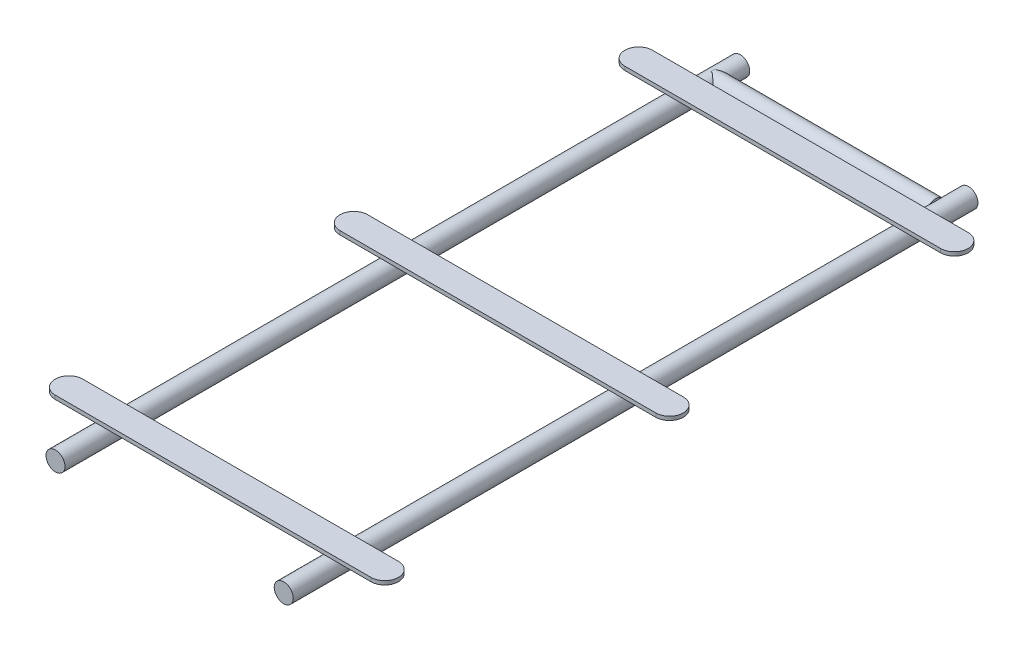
ISO-10303-21;
HEADER;
FILE_DESCRIPTION(('STEP AP214'),'2;1');
FILE_NAME('part.step','',(''),(''),'','','');
FILE_SCHEMA(('AUTOMOTIVE_DESIGN { 1 0 10303 214 1 1 1 1 }'));
ENDSEC;
DATA;
#1=APPLICATION_CONTEXT('core data for automotive mechanical design processes');
#2=APPLICATION_PROTOCOL_DEFINITION('international standard','automotive_design',2000,#1);
#3=PRODUCT_CONTEXT('',#1,'mechanical');
#4=PRODUCT('Part','Part','',(#3));
#5=PRODUCT_RELATED_PRODUCT_CATEGORY('part','',(#4));
#6=PRODUCT_DEFINITION_FORMATION('','',#4);
#7=PRODUCT_DEFINITION_CONTEXT('part definition',#1,'design');
#8=PRODUCT_DEFINITION('design','',#6,#7);
#9=PRODUCT_DEFINITION_SHAPE('','',#8);
#10=(LENGTH_UNIT() NAMED_UNIT(*) SI_UNIT(.MILLI.,.METRE.));
#11=(NAMED_UNIT(*) PLANE_ANGLE_UNIT() SI_UNIT($,.RADIAN.));
#12=(NAMED_UNIT(*) SI_UNIT($,.STERADIAN.) SOLID_ANGLE_UNIT());
#13=UNCERTAINTY_MEASURE_WITH_UNIT(LENGTH_MEASURE(1.E-05),#10,'distance_accuracy_value','');
#14=(GEOMETRIC_REPRESENTATION_CONTEXT(3) GLOBAL_UNCERTAINTY_ASSIGNED_CONTEXT((#13)) GLOBAL_UNIT_ASSIGNED_CONTEXT((#10,
#11,#12)) REPRESENTATION_CONTEXT('',''));
#15=CARTESIAN_POINT('',(0.,0.,0.));
#16=DIRECTION('',(0.,0.,1.));
#17=DIRECTION('',(1.,0.,0.));
#18=AXIS2_PLACEMENT_3D('',#15,#16,#17);
#19=CARTESIAN_POINT('',(58.5,0.0602546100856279,-172.859862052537));
#20=DIRECTION('',(-1.,0.,0.));
#21=DIRECTION('',(0.,0.,1.));
#22=AXIS2_PLACEMENT_3D('',#19,#20,#21);
#23=CYLINDRICAL_SURFACE('',#22,2.5);
#24=CARTESIAN_POINT('',(58.5,0.0602546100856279,-172.859862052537));
#25=DIRECTION('',(1.,0.,0.));
#26=DIRECTION('',(0.,0.,-1.));
#27=AXIS2_PLACEMENT_3D('',#24,#25,#26);
#28=CIRCLE('',#27,2.5);
#29=CARTESIAN_POINT('',(58.5,0.0602546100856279,-170.359862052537));
#30=VERTEX_POINT('',#29);
#31=EDGE_CURVE('E11',#30,#30,#28,.T.);
#32=CARTESIAN_POINT('',(0.,0.0602546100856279,-172.859862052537));
#33=DIRECTION('',(1.,0.,0.));
#34=DIRECTION('',(0.,0.,-1.));
#35=AXIS2_PLACEMENT_3D('',#32,#33,#34);
#36=CIRCLE('',#35,2.5);
#37=CARTESIAN_POINT('',(0.,0.0602546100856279,-170.359862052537));
#38=VERTEX_POINT('',#37);
#39=EDGE_CURVE('E55',#38,#38,#36,.T.);
#40=CARTESIAN_POINT('',(58.5,0.0602546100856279,-170.359862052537));
#41=CARTESIAN_POINT('',(57.890625,0.0602546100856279,-170.359862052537));
#42=CARTESIAN_POINT('',(57.28125,0.0602546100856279,-170.359862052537));
#43=CARTESIAN_POINT('',(56.0625,0.0602546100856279,-170.359862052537));
#44=CARTESIAN_POINT('',(55.453125,0.0602546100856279,-170.359862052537));
#45=CARTESIAN_POINT('',(54.234375,0.0602546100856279,-170.359862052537));
#46=CARTESIAN_POINT('',(53.625,0.0602546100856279,-170.359862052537));
#47=CARTESIAN_POINT('',(52.40625,0.0602546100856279,-170.359862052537));
#48=CARTESIAN_POINT('',(51.796875,0.0602546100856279,-170.359862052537));
#49=CARTESIAN_POINT('',(50.578125,0.0602546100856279,-170.359862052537));
#50=CARTESIAN_POINT('',(49.96875,0.0602546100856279,-170.359862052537));
#51=CARTESIAN_POINT('',(48.75,0.0602546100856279,-170.359862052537));
#52=CARTESIAN_POINT('',(48.140625,0.0602546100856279,-170.359862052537));
#53=CARTESIAN_POINT('',(46.921875,0.0602546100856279,-170.359862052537));
#54=CARTESIAN_POINT('',(46.3125,0.0602546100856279,-170.359862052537));
#55=CARTESIAN_POINT('',(45.09375,0.0602546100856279,-170.359862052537));
#56=CARTESIAN_POINT('',(44.484375,0.0602546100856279,-170.359862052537));
#57=CARTESIAN_POINT('',(43.265625,0.0602546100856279,-170.359862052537));
#58=CARTESIAN_POINT('',(42.65625,0.0602546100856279,-170.359862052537));
#59=CARTESIAN_POINT('',(41.4375,0.0602546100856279,-170.359862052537));
#60=CARTESIAN_POINT('',(40.828125,0.0602546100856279,-170.359862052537));
#61=CARTESIAN_POINT('',(39.609375,0.0602546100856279,-170.359862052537));
#62=CARTESIAN_POINT('',(39.,0.0602546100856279,-170.359862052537));
#63=CARTESIAN_POINT('',(37.78125,0.0602546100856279,-170.359862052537));
#64=CARTESIAN_POINT('',(37.171875,0.0602546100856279,-170.359862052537));
#65=CARTESIAN_POINT('',(35.953125,0.0602546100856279,-170.359862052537));
#66=CARTESIAN_POINT('',(35.34375,0.0602546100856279,-170.359862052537));
#67=CARTESIAN_POINT('',(34.125,0.0602546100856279,-170.359862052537));
#68=CARTESIAN_POINT('',(33.515625,0.0602546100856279,-170.359862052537));
#69=CARTESIAN_POINT('',(32.296875,0.0602546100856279,-170.359862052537));
#70=CARTESIAN_POINT('',(31.6875,0.0602546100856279,-170.359862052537));
#71=CARTESIAN_POINT('',(30.46875,0.0602546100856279,-170.359862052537));
#72=CARTESIAN_POINT('',(29.859375,0.0602546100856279,-170.359862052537));
#73=CARTESIAN_POINT('',(28.640625,0.0602546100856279,-170.359862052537));
#74=CARTESIAN_POINT('',(28.03125,0.0602546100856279,-170.359862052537));
#75=CARTESIAN_POINT('',(26.8125,0.0602546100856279,-170.359862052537));
#76=CARTESIAN_POINT('',(26.203125,0.0602546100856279,-170.359862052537));
#77=CARTESIAN_POINT('',(24.984375,0.0602546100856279,-170.359862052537));
#78=CARTESIAN_POINT('',(24.375,0.0602546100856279,-170.359862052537));
#79=CARTESIAN_POINT('',(23.15625,0.0602546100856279,-170.359862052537));
#80=CARTESIAN_POINT('',(22.546875,0.0602546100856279,-170.359862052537));
#81=CARTESIAN_POINT('',(21.328125,0.0602546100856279,-170.359862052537));
#82=CARTESIAN_POINT('',(20.71875,0.0602546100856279,-170.359862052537));
#83=CARTESIAN_POINT('',(19.5,0.0602546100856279,-170.359862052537));
#84=CARTESIAN_POINT('',(18.890625,0.0602546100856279,-170.359862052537));
#85=CARTESIAN_POINT('',(17.671875,0.0602546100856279,-170.359862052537));
#86=CARTESIAN_POINT('',(17.0625,0.0602546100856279,-170.359862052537));
#87=CARTESIAN_POINT('',(15.84375,0.0602546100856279,-170.359862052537));
#88=CARTESIAN_POINT('',(15.234375,0.0602546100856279,-170.359862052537));
#89=CARTESIAN_POINT('',(14.015625,0.0602546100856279,-170.359862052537));
#90=CARTESIAN_POINT('',(13.40625,0.0602546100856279,-170.359862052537));
#91=CARTESIAN_POINT('',(12.1875,0.0602546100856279,-170.359862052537));
#92=CARTESIAN_POINT('',(11.578125,0.0602546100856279,-170.359862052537));
#93=CARTESIAN_POINT('',(10.359375,0.0602546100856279,-170.359862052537));
#94=CARTESIAN_POINT('',(9.74999999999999,0.0602546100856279,-170.359862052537));
#95=CARTESIAN_POINT('',(8.53124999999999,0.0602546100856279,-170.359862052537));
#96=CARTESIAN_POINT('',(7.92187499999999,0.0602546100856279,-170.359862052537));
#97=CARTESIAN_POINT('',(6.70312499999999,0.0602546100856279,-170.359862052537));
#98=CARTESIAN_POINT('',(6.09374999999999,0.0602546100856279,-170.359862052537));
#99=CARTESIAN_POINT('',(4.87499999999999,0.0602546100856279,-170.359862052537));
#100=CARTESIAN_POINT('',(4.26562499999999,0.0602546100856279,-170.359862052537));
#101=CARTESIAN_POINT('',(3.04687499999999,0.0602546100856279,-170.359862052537));
#102=CARTESIAN_POINT('',(2.43749999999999,0.0602546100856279,-170.359862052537));
#103=CARTESIAN_POINT('',(1.21874999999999,0.0602546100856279,-170.359862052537));
#104=CARTESIAN_POINT('',(0.609374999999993,0.0602546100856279,-170.359862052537));
#105=CARTESIAN_POINT('',(0.,0.0602546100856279,-170.359862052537));
#106=B_SPLINE_CURVE_WITH_KNOTS('',3,(#40,#41,#42,#43,#44,#45,#46,#47,#48,#49,#50,#51,#52,#53,
#54,#55,#56,#57,#58,#59,#60,#61,#62,#63,#64,#65,#66,#67,#68,#69,#70,#71,#72,#73,#74,#75,#76,#77,
#78,#79,#80,#81,#82,#83,#84,#85,#86,#87,#88,#89,#90,#91,#92,#93,#94,#95,#96,#97,#98,#99,#100,
#101,#102,#103,#104,#105),.UNSPECIFIED.,.F.,.F.,(4,2,2,2,2,2,2,2,2,2,2,2,2,2,2,2,2,2,2,2,2,2,2,
2,2,2,2,2,2,2,2,2,4),(0.,1.82812500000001,3.65625000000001,5.48437500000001,7.31250000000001,
9.140625,10.96875,12.796875,14.625,16.453125,18.28125,20.109375,21.9375,23.765625,25.59375,
27.421875,29.25,31.078125,32.90625,34.734375,36.5625,38.390625,40.21875,42.046875,43.875,
45.703125,47.53125,49.359375,51.1875,53.015625,54.84375,56.671875,58.5),.UNSPECIFIED.);
#107=EDGE_CURVE('BSEAM52',#30,#38,#106,.T.);
#108=ORIENTED_EDGE('',*,*,#31,.F.);
#109=ORIENTED_EDGE('',*,*,#39,.T.);
#110=ORIENTED_EDGE('',*,*,#107,.T.);
#111=ORIENTED_EDGE('',*,*,#107,.F.);
#112=EDGE_LOOP('',(#108,#110,#109,#111));
#113=FACE_BOUND('',#112,.T.);
#114=ADVANCED_FACE('F52',(#113),#23,.T.);
#115=CARTESIAN_POINT('',(58.5,0.0602546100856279,-172.859862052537));
#116=DIRECTION('',(1.,0.,0.));
#117=DIRECTION('',(0.,0.,-1.));
#118=AXIS2_PLACEMENT_3D('',#115,#116,#117);
#119=PLANE('',#118);
#120=ORIENTED_EDGE('',*,*,#31,.T.);
#121=EDGE_LOOP('',(#120));
#122=FACE_BOUND('',#121,.T.);
#123=ADVANCED_FACE('F67',(#122),#119,.T.);
#124=CARTESIAN_POINT('',(0.,0.0602546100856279,-172.859862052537));
#125=DIRECTION('',(1.,0.,0.));
#126=DIRECTION('',(0.,0.,-1.));
#127=AXIS2_PLACEMENT_3D('',#124,#125,#126);
#128=PLANE('',#127);
#129=ORIENTED_EDGE('',*,*,#39,.F.);
#130=EDGE_LOOP('',(#129));
#131=FACE_BOUND('',#130,.T.);
#132=ADVANCED_FACE('F65',(#131),#128,.F.);
#133=CLOSED_SHELL('',(#114,#123,#132));
#134=MANIFOLD_SOLID_BREP('B2',#133);
#135=CARTESIAN_POINT('',(-11.5562837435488,3.5,-164.847150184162));
#136=DIRECTION('',(0.,-1.,0.));
#137=DIRECTION('',(0.,0.,-1.));
#138=AXIS2_PLACEMENT_3D('',#135,#136,#137);
#139=CYLINDRICAL_SURFACE('',#138,3.62778060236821);
#140=CARTESIAN_POINT('',(-11.5562837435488,2.5,-164.847150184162));
#141=DIRECTION('',(0.,1.,0.));
#142=DIRECTION('',(0.,0.,1.));
#143=AXIS2_PLACEMENT_3D('',#140,#141,#142);
#144=CIRCLE('',#143,3.62778060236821);
#145=CARTESIAN_POINT('',(-11.5562837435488,2.5,-168.47493078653));
#146=VERTEX_POINT('',#145);
#147=CARTESIAN_POINT('',(-11.5562837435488,2.5,-161.219369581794));
#148=VERTEX_POINT('',#147);
#149=EDGE_CURVE('E50',#146,#148,#144,.T.);
#150=ORIENTED_EDGE('',*,*,#149,.T.);
#151=DIRECTION('',(0.,-1.,0.));
#152=VECTOR('',#151,1.);
#153=CARTESIAN_POINT('',(-11.5562837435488,3.5,-161.219369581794));
#154=LINE('',#153,#152);
#155=CARTESIAN_POINT('',(-11.5562837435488,3.5,-161.219369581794));
#156=VERTEX_POINT('',#155);
#157=EDGE_CURVE('E179',#156,#148,#154,.T.);
#158=ORIENTED_EDGE('',*,*,#157,.F.);
#159=CARTESIAN_POINT('',(-11.5562837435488,3.5,-164.847150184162));
#160=DIRECTION('',(0.,1.,0.));
#161=DIRECTION('',(0.,0.,1.));
#162=AXIS2_PLACEMENT_3D('',#159,#160,#161);
#163=CIRCLE('',#162,3.62778060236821);
#164=CARTESIAN_POINT('',(-11.5562837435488,3.5,-168.47493078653));
#165=VERTEX_POINT('',#164);
#166=EDGE_CURVE('E112',#165,#156,#163,.T.);
#167=ORIENTED_EDGE('',*,*,#166,.F.);
#168=DIRECTION('',(0.,-1.,0.));
#169=VECTOR('',#168,1.);
#170=CARTESIAN_POINT('',(-11.5562837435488,3.5,-168.47493078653));
#171=LINE('',#170,#169);
#172=EDGE_CURVE('E167',#165,#146,#171,.T.);
#173=ORIENTED_EDGE('',*,*,#172,.T.);
#174=EDGE_LOOP('',(#150,#158,#167,#173));
#175=FACE_BOUND('',#174,.T.);
#176=ADVANCED_FACE('F108',(#175),#139,.T.);
#177=CARTESIAN_POINT('',(-11.5562837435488,3.5,-161.219369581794));
#178=DIRECTION('',(0.,0.,-1.));
#179=DIRECTION('',(-1.,0.,0.));
#180=AXIS2_PLACEMENT_3D('',#177,#178,#179);
#181=PLANE('',#180);
#182=DIRECTION('',(1.,0.,0.));
#183=VECTOR('',#182,1.);
#184=CARTESIAN_POINT('',(-11.5562837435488,2.5,-161.219369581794));
#185=LINE('',#184,#183);
#186=CARTESIAN_POINT('',(71.4437162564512,2.5,-161.219369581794));
#187=VERTEX_POINT('',#186);
#188=EDGE_CURVE('E118',#148,#187,#185,.T.);
#189=ORIENTED_EDGE('',*,*,#188,.T.);
#190=DIRECTION('',(0.,-1.,0.));
#191=VECTOR('',#190,1.);
#192=CARTESIAN_POINT('',(71.4437162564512,3.5,-161.219369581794));
#193=LINE('',#192,#191);
#194=CARTESIAN_POINT('',(71.4437162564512,3.5,-161.219369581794));
#195=VERTEX_POINT('',#194);
#196=EDGE_CURVE('E163',#195,#187,#193,.T.);
#197=ORIENTED_EDGE('',*,*,#196,.F.);
#198=DIRECTION('',(1.,0.,0.));
#199=VECTOR('',#198,1.);
#200=CARTESIAN_POINT('',(-11.5562837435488,3.5,-161.219369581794));
#201=LINE('',#200,#199);
#202=EDGE_CURVE('E142',#156,#195,#201,.T.);
#203=ORIENTED_EDGE('',*,*,#202,.F.);
#204=ORIENTED_EDGE('',*,*,#157,.T.);
#205=EDGE_LOOP('',(#189,#197,#203,#204));
#206=FACE_BOUND('',#205,.T.);
#207=ADVANCED_FACE('F182',(#206),#181,.F.);
#208=CARTESIAN_POINT('',(71.4437162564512,3.5,-164.847150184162));
#209=DIRECTION('',(0.,-1.,0.));
#210=DIRECTION('',(0.,0.,-1.));
#211=AXIS2_PLACEMENT_3D('',#208,#209,#210);
#212=CYLINDRICAL_SURFACE('',#211,3.62778060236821);
#213=CARTESIAN_POINT('',(71.4437162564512,2.5,-164.847150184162));
#214=DIRECTION('',(0.,1.,0.));
#215=DIRECTION('',(0.,0.,1.));
#216=AXIS2_PLACEMENT_3D('',#213,#214,#215);
#217=CIRCLE('',#216,3.62778060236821);
#218=CARTESIAN_POINT('',(71.4437162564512,2.5,-168.47493078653));
#219=VERTEX_POINT('',#218);
#220=EDGE_CURVE('E158',#187,#219,#217,.T.);
#221=ORIENTED_EDGE('',*,*,#220,.T.);
#222=DIRECTION('',(0.,-1.,0.));
#223=VECTOR('',#222,1.);
#224=CARTESIAN_POINT('',(71.4437162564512,3.5,-168.47493078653));
#225=LINE('',#224,#223);
#226=CARTESIAN_POINT('',(71.4437162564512,3.5,-168.47493078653));
#227=VERTEX_POINT('',#226);
#228=EDGE_CURVE('E161',#227,#219,#225,.T.);
#229=ORIENTED_EDGE('',*,*,#228,.F.);
#230=CARTESIAN_POINT('',(71.4437162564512,3.5,-164.847150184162));
#231=DIRECTION('',(0.,1.,0.));
#232=DIRECTION('',(0.,0.,1.));
#233=AXIS2_PLACEMENT_3D('',#230,#231,#232);
#234=CIRCLE('',#233,3.62778060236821);
#235=EDGE_CURVE('E175',#195,#227,#234,.T.);
#236=ORIENTED_EDGE('',*,*,#235,.F.);
#237=ORIENTED_EDGE('',*,*,#196,.T.);
#238=EDGE_LOOP('',(#221,#229,#236,#237));
#239=FACE_BOUND('',#238,.T.);
#240=ADVANCED_FACE('F159',(#239),#212,.T.);
#241=CARTESIAN_POINT('',(-11.5562837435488,3.5,-168.47493078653));
#242=DIRECTION('',(0.,0.,1.));
#243=DIRECTION('',(1.,0.,0.));
#244=AXIS2_PLACEMENT_3D('',#241,#242,#243);
#245=PLANE('',#244);
#246=DIRECTION('',(-1.,0.,0.));
#247=VECTOR('',#246,1.);
#248=CARTESIAN_POINT('',(-11.5562837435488,2.5,-168.47493078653));
#249=LINE('',#248,#247);
#250=EDGE_CURVE('E152',#219,#146,#249,.T.);
#251=ORIENTED_EDGE('',*,*,#250,.T.);
#252=ORIENTED_EDGE('',*,*,#172,.F.);
#253=DIRECTION('',(-1.,0.,0.));
#254=VECTOR('',#253,1.);
#255=CARTESIAN_POINT('',(-11.5562837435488,3.5,-168.47493078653));
#256=LINE('',#255,#254);
#257=EDGE_CURVE('E166',#227,#165,#256,.T.);
#258=ORIENTED_EDGE('',*,*,#257,.F.);
#259=ORIENTED_EDGE('',*,*,#228,.T.);
#260=EDGE_LOOP('',(#251,#252,#258,#259));
#261=FACE_BOUND('',#260,.T.);
#262=ADVANCED_FACE('F165',(#261),#245,.F.);
#263=CARTESIAN_POINT('',(-11.5562837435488,3.5,-164.847150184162));
#264=DIRECTION('',(0.,1.,0.));
#265=DIRECTION('',(0.,0.,1.));
#266=AXIS2_PLACEMENT_3D('',#263,#264,#265);
#267=PLANE('',#266);
#268=ORIENTED_EDGE('',*,*,#166,.T.);
#269=ORIENTED_EDGE('',*,*,#202,.T.);
#270=ORIENTED_EDGE('',*,*,#235,.T.);
#271=ORIENTED_EDGE('',*,*,#257,.T.);
#272=EDGE_LOOP('',(#268,#269,#270,#271));
#273=FACE_BOUND('',#272,.T.);
#274=ADVANCED_FACE('F110',(#273),#267,.T.);
#275=CARTESIAN_POINT('',(-11.5562837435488,2.5,-164.847150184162));
#276=DIRECTION('',(0.,1.,0.));
#277=DIRECTION('',(0.,0.,1.));
#278=AXIS2_PLACEMENT_3D('',#275,#276,#277);
#279=PLANE('',#278);
#280=ORIENTED_EDGE('',*,*,#149,.F.);
#281=ORIENTED_EDGE('',*,*,#250,.F.);
#282=ORIENTED_EDGE('',*,*,#220,.F.);
#283=ORIENTED_EDGE('',*,*,#188,.F.);
#284=EDGE_LOOP('',(#280,#281,#282,#283));
#285=FACE_BOUND('',#284,.T.);
#286=ADVANCED_FACE('F169',(#285),#279,.F.);
#287=CLOSED_SHELL('',(#176,#207,#240,#262,#274,#286));
#288=MANIFOLD_SOLID_BREP('B6',#287);
#289=CARTESIAN_POINT('',(-11.5562837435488,3.5,-89.9749307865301));
#290=DIRECTION('',(0.,-1.,0.));
#291=DIRECTION('',(0.,0.,-1.));
#292=AXIS2_PLACEMENT_3D('',#289,#290,#291);
#293=CYLINDRICAL_SURFACE('',#292,3.62778060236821);
#294=CARTESIAN_POINT('',(-11.5562837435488,2.5,-89.9749307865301));
#295=DIRECTION('',(0.,1.,0.));
#296=DIRECTION('',(0.,0.,1.));
#297=AXIS2_PLACEMENT_3D('',#294,#295,#296);
#298=CIRCLE('',#297,3.62778060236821);
#299=CARTESIAN_POINT('',(-11.5562837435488,2.5,-93.6027113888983));
#300=VERTEX_POINT('',#299);
#301=CARTESIAN_POINT('',(-11.5562837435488,2.5,-86.3471501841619));
#302=VERTEX_POINT('',#301);
#303=EDGE_CURVE('E106',#300,#302,#298,.T.);
#304=ORIENTED_EDGE('',*,*,#303,.T.);
#305=DIRECTION('',(0.,-1.,0.));
#306=VECTOR('',#305,1.);
#307=CARTESIAN_POINT('',(-11.5562837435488,3.5,-86.3471501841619));
#308=LINE('',#307,#306);
#309=CARTESIAN_POINT('',(-11.5562837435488,3.5,-86.3471501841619));
#310=VERTEX_POINT('',#309);
#311=EDGE_CURVE('E324',#310,#302,#308,.T.);
#312=ORIENTED_EDGE('',*,*,#311,.F.);
#313=CARTESIAN_POINT('',(-11.5562837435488,3.5,-89.9749307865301));
#314=DIRECTION('',(0.,1.,0.));
#315=DIRECTION('',(0.,0.,1.));
#316=AXIS2_PLACEMENT_3D('',#313,#314,#315);
#317=CIRCLE('',#316,3.62778060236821);
#318=CARTESIAN_POINT('',(-11.5562837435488,3.5,-93.6027113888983));
#319=VERTEX_POINT('',#318);
#320=EDGE_CURVE('E257',#319,#310,#317,.T.);
#321=ORIENTED_EDGE('',*,*,#320,.F.);
#322=DIRECTION('',(0.,-1.,0.));
#323=VECTOR('',#322,1.);
#324=CARTESIAN_POINT('',(-11.5562837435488,3.5,-93.6027113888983));
#325=LINE('',#324,#323);
#326=EDGE_CURVE('E312',#319,#300,#325,.T.);
#327=ORIENTED_EDGE('',*,*,#326,.T.);
#328=EDGE_LOOP('',(#304,#312,#321,#327));
#329=FACE_BOUND('',#328,.T.);
#330=ADVANCED_FACE('F253',(#329),#293,.T.);
#331=CARTESIAN_POINT('',(-11.5562837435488,3.5,-86.3471501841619));
#332=DIRECTION('',(0.,0.,-1.));
#333=DIRECTION('',(-1.,0.,0.));
#334=AXIS2_PLACEMENT_3D('',#331,#332,#333);
#335=PLANE('',#334);
#336=DIRECTION('',(1.,0.,0.));
#337=VECTOR('',#336,1.);
#338=CARTESIAN_POINT('',(-11.5562837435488,2.5,-86.3471501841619));
#339=LINE('',#338,#337);
#340=CARTESIAN_POINT('',(71.4437162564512,2.5,-86.3471501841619));
#341=VERTEX_POINT('',#340);
#342=EDGE_CURVE('E263',#302,#341,#339,.T.);
#343=ORIENTED_EDGE('',*,*,#342,.T.);
#344=DIRECTION('',(0.,-1.,0.));
#345=VECTOR('',#344,1.);
#346=CARTESIAN_POINT('',(71.4437162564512,3.5,-86.3471501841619));
#347=LINE('',#346,#345);
#348=CARTESIAN_POINT('',(71.4437162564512,3.5,-86.3471501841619));
#349=VERTEX_POINT('',#348);
#350=EDGE_CURVE('E308',#349,#341,#347,.T.);
#351=ORIENTED_EDGE('',*,*,#350,.F.);
#352=DIRECTION('',(1.,0.,0.));
#353=VECTOR('',#352,1.);
#354=CARTESIAN_POINT('',(-11.5562837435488,3.5,-86.3471501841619));
#355=LINE('',#354,#353);
#356=EDGE_CURVE('E287',#310,#349,#355,.T.);
#357=ORIENTED_EDGE('',*,*,#356,.F.);
#358=ORIENTED_EDGE('',*,*,#311,.T.);
#359=EDGE_LOOP('',(#343,#351,#357,#358));
#360=FACE_BOUND('',#359,.T.);
#361=ADVANCED_FACE('F327',(#360),#335,.F.);
#362=CARTESIAN_POINT('',(71.4437162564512,3.5,-89.9749307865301));
#363=DIRECTION('',(0.,-1.,0.));
#364=DIRECTION('',(0.,0.,-1.));
#365=AXIS2_PLACEMENT_3D('',#362,#363,#364);
#366=CYLINDRICAL_SURFACE('',#365,3.62778060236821);
#367=CARTESIAN_POINT('',(71.4437162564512,2.5,-89.9749307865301));
#368=DIRECTION('',(0.,1.,0.));
#369=DIRECTION('',(0.,0.,1.));
#370=AXIS2_PLACEMENT_3D('',#367,#368,#369);
#371=CIRCLE('',#370,3.62778060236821);
#372=CARTESIAN_POINT('',(71.4437162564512,2.5,-93.6027113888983));
#373=VERTEX_POINT('',#372);
#374=EDGE_CURVE('E303',#341,#373,#371,.T.);
#375=ORIENTED_EDGE('',*,*,#374,.T.);
#376=DIRECTION('',(0.,-1.,0.));
#377=VECTOR('',#376,1.);
#378=CARTESIAN_POINT('',(71.4437162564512,3.5,-93.6027113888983));
#379=LINE('',#378,#377);
#380=CARTESIAN_POINT('',(71.4437162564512,3.5,-93.6027113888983));
#381=VERTEX_POINT('',#380);
#382=EDGE_CURVE('E306',#381,#373,#379,.T.);
#383=ORIENTED_EDGE('',*,*,#382,.F.);
#384=CARTESIAN_POINT('',(71.4437162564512,3.5,-89.9749307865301));
#385=DIRECTION('',(0.,1.,0.));
#386=DIRECTION('',(0.,0.,1.));
#387=AXIS2_PLACEMENT_3D('',#384,#385,#386);
#388=CIRCLE('',#387,3.62778060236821);
#389=EDGE_CURVE('E320',#349,#381,#388,.T.);
#390=ORIENTED_EDGE('',*,*,#389,.F.);
#391=ORIENTED_EDGE('',*,*,#350,.T.);
#392=EDGE_LOOP('',(#375,#383,#390,#391));
#393=FACE_BOUND('',#392,.T.);
#394=ADVANCED_FACE('F304',(#393),#366,.T.);
#395=CARTESIAN_POINT('',(-11.5562837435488,3.5,-93.6027113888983));
#396=DIRECTION('',(0.,0.,1.));
#397=DIRECTION('',(1.,0.,0.));
#398=AXIS2_PLACEMENT_3D('',#395,#396,#397);
#399=PLANE('',#398);
#400=DIRECTION('',(-1.,0.,0.));
#401=VECTOR('',#400,1.);
#402=CARTESIAN_POINT('',(-11.5562837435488,2.5,-93.6027113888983));
#403=LINE('',#402,#401);
#404=EDGE_CURVE('E297',#373,#300,#403,.T.);
#405=ORIENTED_EDGE('',*,*,#404,.T.);
#406=ORIENTED_EDGE('',*,*,#326,.F.);
#407=DIRECTION('',(-1.,0.,0.));
#408=VECTOR('',#407,1.);
#409=CARTESIAN_POINT('',(-11.5562837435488,3.5,-93.6027113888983));
#410=LINE('',#409,#408);
#411=EDGE_CURVE('E311',#381,#319,#410,.T.);
#412=ORIENTED_EDGE('',*,*,#411,.F.);
#413=ORIENTED_EDGE('',*,*,#382,.T.);
#414=EDGE_LOOP('',(#405,#406,#412,#413));
#415=FACE_BOUND('',#414,.T.);
#416=ADVANCED_FACE('F310',(#415),#399,.F.);
#417=CARTESIAN_POINT('',(-11.5562837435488,3.5,-89.9749307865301));
#418=DIRECTION('',(0.,1.,0.));
#419=DIRECTION('',(0.,0.,1.));
#420=AXIS2_PLACEMENT_3D('',#417,#418,#419);
#421=PLANE('',#420);
#422=ORIENTED_EDGE('',*,*,#320,.T.);
#423=ORIENTED_EDGE('',*,*,#356,.T.);
#424=ORIENTED_EDGE('',*,*,#389,.T.);
#425=ORIENTED_EDGE('',*,*,#411,.T.);
#426=EDGE_LOOP('',(#422,#423,#424,#425));
#427=FACE_BOUND('',#426,.T.);
#428=ADVANCED_FACE('F255',(#427),#421,.T.);
#429=CARTESIAN_POINT('',(-11.5562837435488,2.5,-89.9749307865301));
#430=DIRECTION('',(0.,1.,0.));
#431=DIRECTION('',(0.,0.,1.));
#432=AXIS2_PLACEMENT_3D('',#429,#430,#431);
#433=PLANE('',#432);
#434=ORIENTED_EDGE('',*,*,#303,.F.);
#435=ORIENTED_EDGE('',*,*,#404,.F.);
#436=ORIENTED_EDGE('',*,*,#374,.F.);
#437=ORIENTED_EDGE('',*,*,#342,.F.);
#438=EDGE_LOOP('',(#434,#435,#436,#437));
#439=FACE_BOUND('',#438,.T.);
#440=ADVANCED_FACE('F314',(#439),#433,.F.);
#441=CLOSED_SHELL('',(#330,#361,#394,#416,#428,#440));
#442=MANIFOLD_SOLID_BREP('B44',#441);
#443=CARTESIAN_POINT('',(-11.5562837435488,3.5,-15.1027113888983));
#444=DIRECTION('',(0.,-1.,0.));
#445=DIRECTION('',(0.,0.,-1.));
#446=AXIS2_PLACEMENT_3D('',#443,#444,#445);
#447=CYLINDRICAL_SURFACE('',#446,3.62778060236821);
#448=CARTESIAN_POINT('',(-11.5562837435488,2.5,-15.1027113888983));
#449=DIRECTION('',(0.,1.,0.));
#450=DIRECTION('',(0.,0.,1.));
#451=AXIS2_PLACEMENT_3D('',#448,#449,#450);
#452=CIRCLE('',#451,3.62778060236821);
#453=CARTESIAN_POINT('',(-11.5562837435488,2.5,-18.7304919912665));
#454=VERTEX_POINT('',#453);
#455=CARTESIAN_POINT('',(-11.5562837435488,2.5,-11.4749307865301));
#456=VERTEX_POINT('',#455);
#457=EDGE_CURVE('E459',#454,#456,#452,.T.);
#458=ORIENTED_EDGE('',*,*,#457,.T.);
#459=DIRECTION('',(0.,-1.,0.));
#460=VECTOR('',#459,1.);
#461=CARTESIAN_POINT('',(-11.5562837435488,3.5,-11.4749307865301));
#462=LINE('',#461,#460);
#463=CARTESIAN_POINT('',(-11.5562837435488,3.5,-11.4749307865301));
#464=VERTEX_POINT('',#463);
#465=EDGE_CURVE('E251',#464,#456,#462,.T.);
#466=ORIENTED_EDGE('',*,*,#465,.F.);
#467=CARTESIAN_POINT('',(-11.5562837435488,3.5,-15.1027113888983));
#468=DIRECTION('',(0.,1.,0.));
#469=DIRECTION('',(0.,0.,1.));
#470=AXIS2_PLACEMENT_3D('',#467,#468,#469);
#471=CIRCLE('',#470,3.62778060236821);
#472=CARTESIAN_POINT('',(-11.5562837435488,3.5,-18.7304919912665));
#473=VERTEX_POINT('',#472);
#474=EDGE_CURVE('E447',#473,#464,#471,.T.);
#475=ORIENTED_EDGE('',*,*,#474,.F.);
#476=DIRECTION('',(0.,-1.,0.));
#477=VECTOR('',#476,1.);
#478=CARTESIAN_POINT('',(-11.5562837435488,3.5,-18.7304919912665));
#479=LINE('',#478,#477);
#480=EDGE_CURVE('E455',#473,#454,#479,.T.);
#481=ORIENTED_EDGE('',*,*,#480,.T.);
#482=EDGE_LOOP('',(#458,#466,#475,#481));
#483=FACE_BOUND('',#482,.T.);
#484=ADVANCED_FACE('F396',(#483),#447,.T.);
#485=CARTESIAN_POINT('',(-11.5562837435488,3.5,-11.4749307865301));
#486=DIRECTION('',(0.,0.,-1.));
#487=DIRECTION('',(-1.,0.,0.));
#488=AXIS2_PLACEMENT_3D('',#485,#486,#487);
#489=PLANE('',#488);
#490=DIRECTION('',(1.,0.,0.));
#491=VECTOR('',#490,1.);
#492=CARTESIAN_POINT('',(-11.5562837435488,2.5,-11.4749307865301));
#493=LINE('',#492,#491);
#494=CARTESIAN_POINT('',(71.4437162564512,2.5,-11.4749307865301));
#495=VERTEX_POINT('',#494);
#496=EDGE_CURVE('E451',#456,#495,#493,.T.);
#497=ORIENTED_EDGE('',*,*,#496,.T.);
#498=DIRECTION('',(0.,-1.,0.));
#499=VECTOR('',#498,1.);
#500=CARTESIAN_POINT('',(71.4437162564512,3.5,-11.4749307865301));
#501=LINE('',#500,#499);
#502=CARTESIAN_POINT('',(71.4437162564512,3.5,-11.4749307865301));
#503=VERTEX_POINT('',#502);
#504=EDGE_CURVE('E404',#503,#495,#501,.T.);
#505=ORIENTED_EDGE('',*,*,#504,.F.);
#506=DIRECTION('',(1.,0.,0.));
#507=VECTOR('',#506,1.);
#508=CARTESIAN_POINT('',(-11.5562837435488,3.5,-11.4749307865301));
#509=LINE('',#508,#507);
#510=EDGE_CURVE('E442',#464,#503,#509,.T.);
#511=ORIENTED_EDGE('',*,*,#510,.F.);
#512=ORIENTED_EDGE('',*,*,#465,.T.);
#513=EDGE_LOOP('',(#497,#505,#511,#512));
#514=FACE_BOUND('',#513,.T.);
#515=ADVANCED_FACE('F450',(#514),#489,.F.);
#516=CARTESIAN_POINT('',(71.4437162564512,3.5,-15.1027113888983));
#517=DIRECTION('',(0.,-1.,0.));
#518=DIRECTION('',(0.,0.,-1.));
#519=AXIS2_PLACEMENT_3D('',#516,#517,#518);
#520=CYLINDRICAL_SURFACE('',#519,3.62778060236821);
#521=CARTESIAN_POINT('',(71.4437162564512,2.5,-15.1027113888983));
#522=DIRECTION('',(0.,1.,0.));
#523=DIRECTION('',(0.,0.,1.));
#524=AXIS2_PLACEMENT_3D('',#521,#522,#523);
#525=CIRCLE('',#524,3.62778060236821);
#526=CARTESIAN_POINT('',(71.4437162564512,2.5,-18.7304919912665));
#527=VERTEX_POINT('',#526);
#528=EDGE_CURVE('E429',#495,#527,#525,.T.);
#529=ORIENTED_EDGE('',*,*,#528,.T.);
#530=DIRECTION('',(0.,-1.,0.));
#531=VECTOR('',#530,1.);
#532=CARTESIAN_POINT('',(71.4437162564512,3.5,-18.7304919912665));
#533=LINE('',#532,#531);
#534=CARTESIAN_POINT('',(71.4437162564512,3.5,-18.7304919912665));
#535=VERTEX_POINT('',#534);
#536=EDGE_CURVE('E452',#535,#527,#533,.T.);
#537=ORIENTED_EDGE('',*,*,#536,.F.);
#538=CARTESIAN_POINT('',(71.4437162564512,3.5,-15.1027113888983));
#539=DIRECTION('',(0.,1.,0.));
#540=DIRECTION('',(0.,0.,1.));
#541=AXIS2_PLACEMENT_3D('',#538,#539,#540);
#542=CIRCLE('',#541,3.62778060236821);
#543=EDGE_CURVE('E445',#503,#535,#542,.T.);
#544=ORIENTED_EDGE('',*,*,#543,.F.);
#545=ORIENTED_EDGE('',*,*,#504,.T.);
#546=EDGE_LOOP('',(#529,#537,#544,#545));
#547=FACE_BOUND('',#546,.T.);
#548=ADVANCED_FACE('F453',(#547),#520,.T.);
#549=CARTESIAN_POINT('',(-11.5562837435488,3.5,-18.7304919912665));
#550=DIRECTION('',(0.,0.,1.));
#551=DIRECTION('',(1.,0.,0.));
#552=AXIS2_PLACEMENT_3D('',#549,#550,#551);
#553=PLANE('',#552);
#554=DIRECTION('',(-1.,0.,0.));
#555=VECTOR('',#554,1.);
#556=CARTESIAN_POINT('',(-11.5562837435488,2.5,-18.7304919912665));
#557=LINE('',#556,#555);
#558=EDGE_CURVE('E435',#527,#454,#557,.T.);
#559=ORIENTED_EDGE('',*,*,#558,.T.);
#560=ORIENTED_EDGE('',*,*,#480,.F.);
#561=DIRECTION('',(-1.,0.,0.));
#562=VECTOR('',#561,1.);
#563=CARTESIAN_POINT('',(-11.5562837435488,3.5,-18.7304919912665));
#564=LINE('',#563,#562);
#565=EDGE_CURVE('E412',#535,#473,#564,.T.);
#566=ORIENTED_EDGE('',*,*,#565,.F.);
#567=ORIENTED_EDGE('',*,*,#536,.T.);
#568=EDGE_LOOP('',(#559,#560,#566,#567));
#569=FACE_BOUND('',#568,.T.);
#570=ADVANCED_FACE('F466',(#569),#553,.F.);
#571=CARTESIAN_POINT('',(-11.5562837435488,3.5,-15.1027113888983));
#572=DIRECTION('',(0.,1.,0.));
#573=DIRECTION('',(0.,0.,1.));
#574=AXIS2_PLACEMENT_3D('',#571,#572,#573);
#575=PLANE('',#574);
#576=ORIENTED_EDGE('',*,*,#474,.T.);
#577=ORIENTED_EDGE('',*,*,#510,.T.);
#578=ORIENTED_EDGE('',*,*,#543,.T.);
#579=ORIENTED_EDGE('',*,*,#565,.T.);
#580=EDGE_LOOP('',(#576,#577,#578,#579));
#581=FACE_BOUND('',#580,.T.);
#582=ADVANCED_FACE('F443',(#581),#575,.T.);
#583=CARTESIAN_POINT('',(-11.5562837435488,2.5,-15.1027113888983));
#584=DIRECTION('',(0.,1.,0.));
#585=DIRECTION('',(0.,0.,1.));
#586=AXIS2_PLACEMENT_3D('',#583,#584,#585);
#587=PLANE('',#586);
#588=ORIENTED_EDGE('',*,*,#457,.F.);
#589=ORIENTED_EDGE('',*,*,#558,.F.);
#590=ORIENTED_EDGE('',*,*,#528,.F.);
#591=ORIENTED_EDGE('',*,*,#496,.F.);
#592=EDGE_LOOP('',(#588,#589,#590,#591));
#593=FACE_BOUND('',#592,.T.);
#594=ADVANCED_FACE('F469',(#593),#587,.F.);
#595=CLOSED_SHELL('',(#484,#515,#548,#570,#582,#594));
#596=MANIFOLD_SOLID_BREP('B100',#595);
#597=CARTESIAN_POINT('',(60.,0.,-180.));
#598=DIRECTION('',(0.,0.,1.));
#599=DIRECTION('',(1.,0.,0.));
#600=AXIS2_PLACEMENT_3D('',#597,#598,#599);
#601=CYLINDRICAL_SURFACE('',#600,2.5);
#602=CARTESIAN_POINT('',(60.,0.,-180.));
#603=DIRECTION('',(0.,0.,1.));
#604=DIRECTION('',(1.,0.,0.));
#605=AXIS2_PLACEMENT_3D('',#602,#603,#604);
#606=CIRCLE('',#605,2.5);
#607=CARTESIAN_POINT('',(62.5,0.,-180.));
#608=VERTEX_POINT('',#607);
#609=EDGE_CURVE('E542',#608,#608,#606,.T.);
#610=CARTESIAN_POINT('',(60.,0.,0.));
#611=DIRECTION('',(0.,0.,1.));
#612=DIRECTION('',(1.,0.,0.));
#613=AXIS2_PLACEMENT_3D('',#610,#611,#612);
#614=CIRCLE('',#613,2.5);
#615=CARTESIAN_POINT('',(62.5,0.,0.));
#616=VERTEX_POINT('',#615);
#617=EDGE_CURVE('E395',#616,#616,#614,.T.);
#618=CARTESIAN_POINT('',(62.5,0.,-180.));
#619=CARTESIAN_POINT('',(62.5,0.,-178.125));
#620=CARTESIAN_POINT('',(62.5,0.,-176.25));
#621=CARTESIAN_POINT('',(62.5,0.,-172.5));
#622=CARTESIAN_POINT('',(62.5,0.,-170.625));
#623=CARTESIAN_POINT('',(62.5,0.,-166.875));
#624=CARTESIAN_POINT('',(62.5,0.,-165.));
#625=CARTESIAN_POINT('',(62.5,0.,-161.25));
#626=CARTESIAN_POINT('',(62.5,0.,-159.375));
#627=CARTESIAN_POINT('',(62.5,0.,-155.625));
#628=CARTESIAN_POINT('',(62.5,0.,-153.75));
#629=CARTESIAN_POINT('',(62.5,0.,-150.));
#630=CARTESIAN_POINT('',(62.5,0.,-148.125));
#631=CARTESIAN_POINT('',(62.5,0.,-144.375));
#632=CARTESIAN_POINT('',(62.5,0.,-142.5));
#633=CARTESIAN_POINT('',(62.5,0.,-138.75));
#634=CARTESIAN_POINT('',(62.5,0.,-136.875));
#635=CARTESIAN_POINT('',(62.5,0.,-133.125));
#636=CARTESIAN_POINT('',(62.5,0.,-131.25));
#637=CARTESIAN_POINT('',(62.5,0.,-127.5));
#638=CARTESIAN_POINT('',(62.5,0.,-125.625));
#639=CARTESIAN_POINT('',(62.5,0.,-121.875));
#640=CARTESIAN_POINT('',(62.5,0.,-120.));
#641=CARTESIAN_POINT('',(62.5,0.,-116.25));
#642=CARTESIAN_POINT('',(62.5,0.,-114.375));
#643=CARTESIAN_POINT('',(62.5,0.,-110.625));
#644=CARTESIAN_POINT('',(62.5,0.,-108.75));
#645=CARTESIAN_POINT('',(62.5,0.,-105.));
#646=CARTESIAN_POINT('',(62.5,0.,-103.125));
#647=CARTESIAN_POINT('',(62.5,0.,-99.375));
#648=CARTESIAN_POINT('',(62.5,0.,-97.5));
#649=CARTESIAN_POINT('',(62.5,0.,-93.75));
#650=CARTESIAN_POINT('',(62.5,0.,-91.875));
#651=CARTESIAN_POINT('',(62.5,0.,-88.125));
#652=CARTESIAN_POINT('',(62.5,0.,-86.25));
#653=CARTESIAN_POINT('',(62.5,0.,-82.5));
#654=CARTESIAN_POINT('',(62.5,0.,-80.625));
#655=CARTESIAN_POINT('',(62.5,0.,-76.875));
#656=CARTESIAN_POINT('',(62.5,0.,-75.));
#657=CARTESIAN_POINT('',(62.5,0.,-71.25));
#658=CARTESIAN_POINT('',(62.5,0.,-69.375));
#659=CARTESIAN_POINT('',(62.5,0.,-65.625));
#660=CARTESIAN_POINT('',(62.5,0.,-63.75));
#661=CARTESIAN_POINT('',(62.5,0.,-60.));
#662=CARTESIAN_POINT('',(62.5,0.,-58.125));
#663=CARTESIAN_POINT('',(62.5,0.,-54.375));
#664=CARTESIAN_POINT('',(62.5,0.,-52.5));
#665=CARTESIAN_POINT('',(62.5,0.,-48.75));
#666=CARTESIAN_POINT('',(62.5,0.,-46.875));
#667=CARTESIAN_POINT('',(62.5,0.,-43.125));
#668=CARTESIAN_POINT('',(62.5,0.,-41.25));
#669=CARTESIAN_POINT('',(62.5,0.,-37.5));
#670=CARTESIAN_POINT('',(62.5,0.,-35.625));
#671=CARTESIAN_POINT('',(62.5,0.,-31.875));
#672=CARTESIAN_POINT('',(62.5,0.,-30.));
#673=CARTESIAN_POINT('',(62.5,0.,-26.25));
#674=CARTESIAN_POINT('',(62.5,0.,-24.375));
#675=CARTESIAN_POINT('',(62.5,0.,-20.625));
#676=CARTESIAN_POINT('',(62.5,0.,-18.75));
#677=CARTESIAN_POINT('',(62.5,0.,-15.));
#678=CARTESIAN_POINT('',(62.5,0.,-13.125));
#679=CARTESIAN_POINT('',(62.5,0.,-9.37500000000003));
#680=CARTESIAN_POINT('',(62.5,0.,-7.50000000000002));
#681=CARTESIAN_POINT('',(62.5,0.,-3.75000000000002));
#682=CARTESIAN_POINT('',(62.5,0.,-1.87500000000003));
#683=CARTESIAN_POINT('',(62.5,0.,0.));
#684=B_SPLINE_CURVE_WITH_KNOTS('',3,(#618,#619,#620,#621,#622,#623,#624,#625,#626,#627,#628,
#629,#630,#631,#632,#633,#634,#635,#636,#637,#638,#639,#640,#641,#642,#643,#644,#645,#646,#647,
#648,#649,#650,#651,#652,#653,#654,#655,#656,#657,#658,#659,#660,#661,#662,#663,#664,#665,#666,
#667,#668,#669,#670,#671,#672,#673,#674,#675,#676,#677,#678,#679,#680,#681,#682,#683),
.UNSPECIFIED.,.F.,.F.,(4,2,2,2,2,2,2,2,2,2,2,2,2,2,2,2,2,2,2,2,2,2,2,2,2,2,2,2,2,2,2,2,4),(0.,
5.62499999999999,11.25,16.875,22.5,28.125,33.75,39.375,45.,50.625,56.25,61.875,67.5,73.125,
78.75,84.375,90.,95.625,101.25,106.875,112.5,118.125,123.75,129.375,135.,140.625,146.25,151.875,
157.5,163.125,168.75,174.375,180.),.UNSPECIFIED.);
#685=EDGE_CURVE('BSEAM538',#608,#616,#684,.T.);
#686=ORIENTED_EDGE('',*,*,#609,.T.);
#687=ORIENTED_EDGE('',*,*,#617,.F.);
#688=ORIENTED_EDGE('',*,*,#685,.T.);
#689=ORIENTED_EDGE('',*,*,#685,.F.);
#690=EDGE_LOOP('',(#686,#688,#687,#689));
#691=FACE_BOUND('',#690,.T.);
#692=ADVANCED_FACE('F538',(#691),#601,.T.);
#693=CARTESIAN_POINT('',(60.,0.,-180.));
#694=DIRECTION('',(0.,0.,1.));
#695=DIRECTION('',(1.,0.,0.));
#696=AXIS2_PLACEMENT_3D('',#693,#694,#695);
#697=PLANE('',#696);
#698=ORIENTED_EDGE('',*,*,#609,.F.);
#699=EDGE_LOOP('',(#698));
#700=FACE_BOUND('',#699,.T.);
#701=ADVANCED_FACE('F540',(#700),#697,.F.);
#702=CARTESIAN_POINT('',(60.,0.,0.));
#703=DIRECTION('',(0.,0.,1.));
#704=DIRECTION('',(1.,0.,0.));
#705=AXIS2_PLACEMENT_3D('',#702,#703,#704);
#706=PLANE('',#705);
#707=ORIENTED_EDGE('',*,*,#617,.T.);
#708=EDGE_LOOP('',(#707));
#709=FACE_BOUND('',#708,.T.);
#710=ADVANCED_FACE('F556',(#709),#706,.T.);
#711=CLOSED_SHELL('',(#692,#701,#710));
#712=MANIFOLD_SOLID_BREP('B245',#711);
#713=CARTESIAN_POINT('',(0.,0.,-180.));
#714=DIRECTION('',(0.,0.,1.));
#715=DIRECTION('',(1.,0.,0.));
#716=AXIS2_PLACEMENT_3D('',#713,#714,#715);
#717=CYLINDRICAL_SURFACE('',#716,2.5);
#718=CARTESIAN_POINT('',(0.,0.,-180.));
#719=DIRECTION('',(0.,0.,1.));
#720=DIRECTION('',(1.,0.,0.));
#721=AXIS2_PLACEMENT_3D('',#718,#719,#720);
#722=CIRCLE('',#721,2.5);
#723=CARTESIAN_POINT('',(2.5,0.,-180.));
#724=VERTEX_POINT('',#723);
#725=EDGE_CURVE('E537',#724,#724,#722,.T.);
#726=CARTESIAN_POINT('',(0.,0.,0.));
#727=DIRECTION('',(0.,0.,1.));
#728=DIRECTION('',(1.,0.,0.));
#729=AXIS2_PLACEMENT_3D('',#726,#727,#728);
#730=CIRCLE('',#729,2.5);
#731=CARTESIAN_POINT('',(2.5,0.,0.));
#732=VERTEX_POINT('',#731);
#733=EDGE_CURVE('E587',#732,#732,#730,.T.);
#734=CARTESIAN_POINT('',(2.5,0.,-180.));
#735=CARTESIAN_POINT('',(2.5,0.,-178.125));
#736=CARTESIAN_POINT('',(2.5,0.,-176.25));
#737=CARTESIAN_POINT('',(2.5,0.,-172.5));
#738=CARTESIAN_POINT('',(2.5,0.,-170.625));
#739=CARTESIAN_POINT('',(2.5,0.,-166.875));
#740=CARTESIAN_POINT('',(2.5,0.,-165.));
#741=CARTESIAN_POINT('',(2.5,0.,-161.25));
#742=CARTESIAN_POINT('',(2.5,0.,-159.375));
#743=CARTESIAN_POINT('',(2.5,0.,-155.625));
#744=CARTESIAN_POINT('',(2.5,0.,-153.75));
#745=CARTESIAN_POINT('',(2.5,0.,-150.));
#746=CARTESIAN_POINT('',(2.5,0.,-148.125));
#747=CARTESIAN_POINT('',(2.5,0.,-144.375));
#748=CARTESIAN_POINT('',(2.5,0.,-142.5));
#749=CARTESIAN_POINT('',(2.5,0.,-138.75));
#750=CARTESIAN_POINT('',(2.5,0.,-136.875));
#751=CARTESIAN_POINT('',(2.5,0.,-133.125));
#752=CARTESIAN_POINT('',(2.5,0.,-131.25));
#753=CARTESIAN_POINT('',(2.5,0.,-127.5));
#754=CARTESIAN_POINT('',(2.5,0.,-125.625));
#755=CARTESIAN_POINT('',(2.5,0.,-121.875));
#756=CARTESIAN_POINT('',(2.5,0.,-120.));
#757=CARTESIAN_POINT('',(2.5,0.,-116.25));
#758=CARTESIAN_POINT('',(2.5,0.,-114.375));
#759=CARTESIAN_POINT('',(2.5,0.,-110.625));
#760=CARTESIAN_POINT('',(2.5,0.,-108.75));
#761=CARTESIAN_POINT('',(2.5,0.,-105.));
#762=CARTESIAN_POINT('',(2.5,0.,-103.125));
#763=CARTESIAN_POINT('',(2.5,0.,-99.375));
#764=CARTESIAN_POINT('',(2.5,0.,-97.5));
#765=CARTESIAN_POINT('',(2.5,0.,-93.75));
#766=CARTESIAN_POINT('',(2.5,0.,-91.875));
#767=CARTESIAN_POINT('',(2.5,0.,-88.125));
#768=CARTESIAN_POINT('',(2.5,0.,-86.25));
#769=CARTESIAN_POINT('',(2.5,0.,-82.5));
#770=CARTESIAN_POINT('',(2.5,0.,-80.625));
#771=CARTESIAN_POINT('',(2.5,0.,-76.875));
#772=CARTESIAN_POINT('',(2.5,0.,-75.));
#773=CARTESIAN_POINT('',(2.5,0.,-71.25));
#774=CARTESIAN_POINT('',(2.5,0.,-69.375));
#775=CARTESIAN_POINT('',(2.5,0.,-65.625));
#776=CARTESIAN_POINT('',(2.5,0.,-63.75));
#777=CARTESIAN_POINT('',(2.5,0.,-60.));
#778=CARTESIAN_POINT('',(2.5,0.,-58.125));
#779=CARTESIAN_POINT('',(2.5,0.,-54.375));
#780=CARTESIAN_POINT('',(2.5,0.,-52.5));
#781=CARTESIAN_POINT('',(2.5,0.,-48.75));
#782=CARTESIAN_POINT('',(2.5,0.,-46.875));
#783=CARTESIAN_POINT('',(2.5,0.,-43.125));
#784=CARTESIAN_POINT('',(2.5,0.,-41.25));
#785=CARTESIAN_POINT('',(2.5,0.,-37.5));
#786=CARTESIAN_POINT('',(2.5,0.,-35.625));
#787=CARTESIAN_POINT('',(2.5,0.,-31.875));
#788=CARTESIAN_POINT('',(2.5,0.,-30.));
#789=CARTESIAN_POINT('',(2.5,0.,-26.25));
#790=CARTESIAN_POINT('',(2.5,0.,-24.375));
#791=CARTESIAN_POINT('',(2.5,0.,-20.625));
#792=CARTESIAN_POINT('',(2.5,0.,-18.75));
#793=CARTESIAN_POINT('',(2.5,0.,-15.));
#794=CARTESIAN_POINT('',(2.5,0.,-13.125));
#795=CARTESIAN_POINT('',(2.5,0.,-9.37500000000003));
#796=CARTESIAN_POINT('',(2.5,0.,-7.50000000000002));
#797=CARTESIAN_POINT('',(2.5,0.,-3.75000000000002));
#798=CARTESIAN_POINT('',(2.5,0.,-1.87500000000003));
#799=CARTESIAN_POINT('',(2.5,0.,0.));
#800=B_SPLINE_CURVE_WITH_KNOTS('',3,(#734,#735,#736,#737,#738,#739,#740,#741,#742,#743,#744,
#745,#746,#747,#748,#749,#750,#751,#752,#753,#754,#755,#756,#757,#758,#759,#760,#761,#762,#763,
#764,#765,#766,#767,#768,#769,#770,#771,#772,#773,#774,#775,#776,#777,#778,#779,#780,#781,#782,
#783,#784,#785,#786,#787,#788,#789,#790,#791,#792,#793,#794,#795,#796,#797,#798,#799),
.UNSPECIFIED.,.F.,.F.,(4,2,2,2,2,2,2,2,2,2,2,2,2,2,2,2,2,2,2,2,2,2,2,2,2,2,2,2,2,2,2,2,4),(0.,
5.62499999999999,11.25,16.875,22.5,28.125,33.75,39.375,45.,50.625,56.25,61.875,67.5,73.125,
78.75,84.375,90.,95.625,101.25,106.875,112.5,118.125,123.75,129.375,135.,140.625,146.25,151.875,
157.5,163.125,168.75,174.375,180.),.UNSPECIFIED.);
#801=EDGE_CURVE('BSEAM584',#724,#732,#800,.T.);
#802=ORIENTED_EDGE('',*,*,#725,.T.);
#803=ORIENTED_EDGE('',*,*,#733,.F.);
#804=ORIENTED_EDGE('',*,*,#801,.T.);
#805=ORIENTED_EDGE('',*,*,#801,.F.);
#806=EDGE_LOOP('',(#802,#804,#803,#805));
#807=FACE_BOUND('',#806,.T.);
#808=ADVANCED_FACE('F584',(#807),#717,.T.);
#809=CARTESIAN_POINT('',(0.,0.,-180.));
#810=DIRECTION('',(0.,0.,1.));
#811=DIRECTION('',(1.,0.,0.));
#812=AXIS2_PLACEMENT_3D('',#809,#810,#811);
#813=PLANE('',#812);
#814=ORIENTED_EDGE('',*,*,#725,.F.);
#815=EDGE_LOOP('',(#814));
#816=FACE_BOUND('',#815,.T.);
#817=ADVANCED_FACE('F599',(#816),#813,.F.);
#818=CARTESIAN_POINT('',(0.,0.,0.));
#819=DIRECTION('',(0.,0.,1.));
#820=DIRECTION('',(1.,0.,0.));
#821=AXIS2_PLACEMENT_3D('',#818,#819,#820);
#822=PLANE('',#821);
#823=ORIENTED_EDGE('',*,*,#733,.T.);
#824=EDGE_LOOP('',(#823));
#825=FACE_BOUND('',#824,.T.);
#826=ADVANCED_FACE('F596',(#825),#822,.T.);
#827=CLOSED_SHELL('',(#808,#817,#826));
#828=MANIFOLD_SOLID_BREP('B390',#827);
#829=ADVANCED_BREP_SHAPE_REPRESENTATION('',(#18,#134,#288,#442,#596,#712,#828),#14);
#830=SHAPE_DEFINITION_REPRESENTATION(#9,#829);
ENDSEC;
END-ISO-10303-21;
